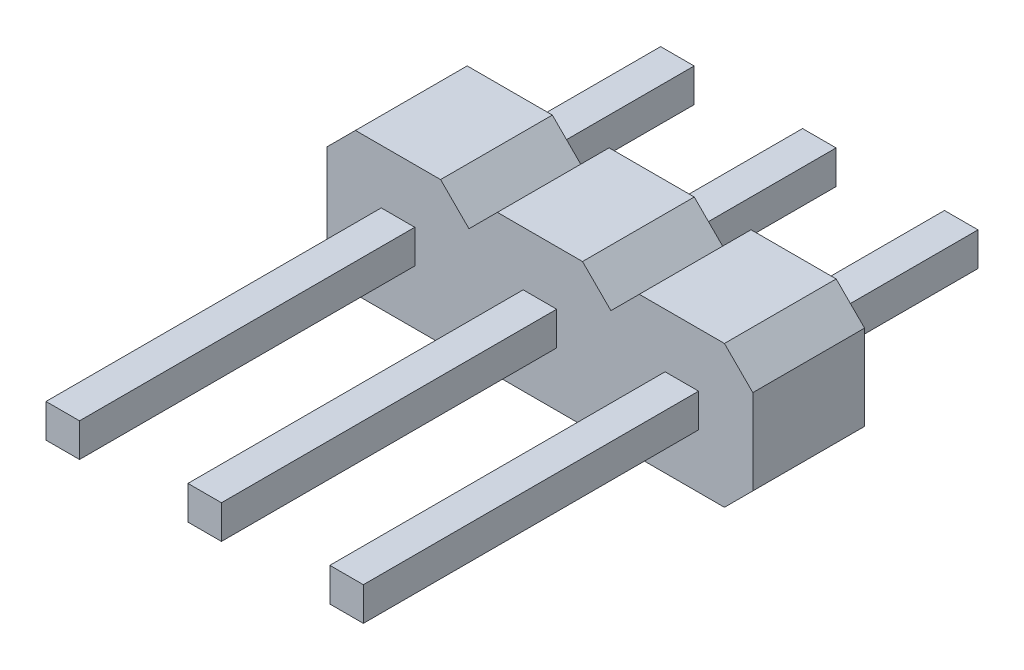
ISO-10303-21;
HEADER;
FILE_DESCRIPTION(('STEP AP214'),'2;1');
FILE_NAME('part.step','',(''),(''),'','','');
FILE_SCHEMA(('AUTOMOTIVE_DESIGN { 1 0 10303 214 1 1 1 1 }'));
ENDSEC;
DATA;
#1=APPLICATION_CONTEXT('core data for automotive mechanical design processes');
#2=APPLICATION_PROTOCOL_DEFINITION('international standard','automotive_design',2000,#1);
#3=PRODUCT_CONTEXT('',#1,'mechanical');
#4=PRODUCT('Part','Part','',(#3));
#5=PRODUCT_RELATED_PRODUCT_CATEGORY('part','',(#4));
#6=PRODUCT_DEFINITION_FORMATION('','',#4);
#7=PRODUCT_DEFINITION_CONTEXT('part definition',#1,'design');
#8=PRODUCT_DEFINITION('design','',#6,#7);
#9=PRODUCT_DEFINITION_SHAPE('','',#8);
#10=(LENGTH_UNIT() NAMED_UNIT(*) SI_UNIT(.MILLI.,.METRE.));
#11=(NAMED_UNIT(*) PLANE_ANGLE_UNIT() SI_UNIT($,.RADIAN.));
#12=(NAMED_UNIT(*) SI_UNIT($,.STERADIAN.) SOLID_ANGLE_UNIT());
#13=UNCERTAINTY_MEASURE_WITH_UNIT(LENGTH_MEASURE(1.E-05),#10,'distance_accuracy_value','');
#14=(GEOMETRIC_REPRESENTATION_CONTEXT(3) GLOBAL_UNCERTAINTY_ASSIGNED_CONTEXT((#13)) GLOBAL_UNIT_ASSIGNED_CONTEXT((#10,
#11,#12)) REPRESENTATION_CONTEXT('',''));
#15=CARTESIAN_POINT('',(0.,0.,0.));
#16=DIRECTION('',(0.,0.,1.));
#17=DIRECTION('',(1.,0.,0.));
#18=AXIS2_PLACEMENT_3D('',#15,#16,#17);
#19=CARTESIAN_POINT('',(0.,0.,2.));
#20=DIRECTION('',(0.,0.,1.));
#21=DIRECTION('',(1.,0.,0.));
#22=AXIS2_PLACEMENT_3D('',#19,#20,#21);
#23=PLANE('',#22);
#24=DIRECTION('',(0.,-1.,0.));
#25=VECTOR('',#24,1.);
#26=CARTESIAN_POINT('',(-1.27,0.762,2.));
#27=LINE('',#26,#25);
#28=CARTESIAN_POINT('',(-1.27,0.762,2.));
#29=VERTEX_POINT('',#28);
#30=CARTESIAN_POINT('',(-1.27,-0.762,2.));
#31=VERTEX_POINT('',#30);
#32=EDGE_CURVE('E11',#29,#31,#27,.T.);
#33=ORIENTED_EDGE('',*,*,#32,.T.);
#34=DIRECTION('',(0.707106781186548,-0.707106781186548,0.));
#35=VECTOR('',#34,1.);
#36=CARTESIAN_POINT('',(-1.27,-0.762,2.));
#37=LINE('',#36,#35);
#38=CARTESIAN_POINT('',(-0.762,-1.27,2.));
#39=VERTEX_POINT('',#38);
#40=EDGE_CURVE('E25',#31,#39,#37,.T.);
#41=ORIENTED_EDGE('',*,*,#40,.T.);
#42=DIRECTION('',(1.,0.,0.));
#43=VECTOR('',#42,1.);
#44=CARTESIAN_POINT('',(-0.762,-1.27,2.));
#45=LINE('',#44,#43);
#46=CARTESIAN_POINT('',(0.762,-1.27,2.));
#47=VERTEX_POINT('',#46);
#48=EDGE_CURVE('E882',#39,#47,#45,.T.);
#49=ORIENTED_EDGE('',*,*,#48,.T.);
#50=DIRECTION('',(0.707106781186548,0.707106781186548,0.));
#51=VECTOR('',#50,1.);
#52=CARTESIAN_POINT('',(1.27,-0.762,2.));
#53=LINE('',#52,#51);
#54=CARTESIAN_POINT('',(1.27,-0.762,2.));
#55=VERTEX_POINT('',#54);
#56=EDGE_CURVE('E878',#47,#55,#53,.T.);
#57=ORIENTED_EDGE('',*,*,#56,.T.);
#58=DIRECTION('',(0.707106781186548,-0.707106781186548,0.));
#59=VECTOR('',#58,1.);
#60=CARTESIAN_POINT('',(1.27,-0.762,2.));
#61=LINE('',#60,#59);
#62=CARTESIAN_POINT('',(1.778,-1.27,2.));
#63=VERTEX_POINT('',#62);
#64=EDGE_CURVE('E874',#55,#63,#61,.T.);
#65=ORIENTED_EDGE('',*,*,#64,.T.);
#66=DIRECTION('',(1.,0.,0.));
#67=VECTOR('',#66,1.);
#68=CARTESIAN_POINT('',(1.778,-1.27,2.));
#69=LINE('',#68,#67);
#70=CARTESIAN_POINT('',(3.302,-1.27,2.));
#71=VERTEX_POINT('',#70);
#72=EDGE_CURVE('E870',#63,#71,#69,.T.);
#73=ORIENTED_EDGE('',*,*,#72,.T.);
#74=DIRECTION('',(0.707106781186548,0.707106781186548,0.));
#75=VECTOR('',#74,1.);
#76=CARTESIAN_POINT('',(3.81,-0.762,2.));
#77=LINE('',#76,#75);
#78=CARTESIAN_POINT('',(3.81,-0.762,2.));
#79=VERTEX_POINT('',#78);
#80=EDGE_CURVE('E866',#71,#79,#77,.T.);
#81=ORIENTED_EDGE('',*,*,#80,.T.);
#82=DIRECTION('',(0.707106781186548,-0.707106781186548,0.));
#83=VECTOR('',#82,1.);
#84=CARTESIAN_POINT('',(3.81,-0.762,2.));
#85=LINE('',#84,#83);
#86=CARTESIAN_POINT('',(4.318,-1.27,2.));
#87=VERTEX_POINT('',#86);
#88=EDGE_CURVE('E862',#79,#87,#85,.T.);
#89=ORIENTED_EDGE('',*,*,#88,.T.);
#90=DIRECTION('',(1.,0.,0.));
#91=VECTOR('',#90,1.);
#92=CARTESIAN_POINT('',(4.318,-1.27,2.));
#93=LINE('',#92,#91);
#94=CARTESIAN_POINT('',(5.842,-1.27,2.));
#95=VERTEX_POINT('',#94);
#96=EDGE_CURVE('E858',#87,#95,#93,.T.);
#97=ORIENTED_EDGE('',*,*,#96,.T.);
#98=DIRECTION('',(0.707106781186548,0.707106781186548,0.));
#99=VECTOR('',#98,1.);
#100=CARTESIAN_POINT('',(6.35,-0.762,2.));
#101=LINE('',#100,#99);
#102=CARTESIAN_POINT('',(6.35,-0.762,2.));
#103=VERTEX_POINT('',#102);
#104=EDGE_CURVE('E854',#95,#103,#101,.T.);
#105=ORIENTED_EDGE('',*,*,#104,.T.);
#106=DIRECTION('',(0.,1.,0.));
#107=VECTOR('',#106,1.);
#108=CARTESIAN_POINT('',(6.35,0.762,2.));
#109=LINE('',#108,#107);
#110=CARTESIAN_POINT('',(6.35,0.762,2.));
#111=VERTEX_POINT('',#110);
#112=EDGE_CURVE('E850',#103,#111,#109,.T.);
#113=ORIENTED_EDGE('',*,*,#112,.T.);
#114=DIRECTION('',(-0.707106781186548,0.707106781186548,0.));
#115=VECTOR('',#114,1.);
#116=CARTESIAN_POINT('',(5.842,1.27,2.));
#117=LINE('',#116,#115);
#118=CARTESIAN_POINT('',(5.842,1.27,2.));
#119=VERTEX_POINT('',#118);
#120=EDGE_CURVE('E846',#111,#119,#117,.T.);
#121=ORIENTED_EDGE('',*,*,#120,.T.);
#122=DIRECTION('',(-1.,0.,0.));
#123=VECTOR('',#122,1.);
#124=CARTESIAN_POINT('',(4.318,1.27,2.));
#125=LINE('',#124,#123);
#126=CARTESIAN_POINT('',(4.318,1.27,2.));
#127=VERTEX_POINT('',#126);
#128=EDGE_CURVE('E842',#119,#127,#125,.T.);
#129=ORIENTED_EDGE('',*,*,#128,.T.);
#130=DIRECTION('',(-0.707106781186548,-0.707106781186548,0.));
#131=VECTOR('',#130,1.);
#132=CARTESIAN_POINT('',(4.318,1.27,2.));
#133=LINE('',#132,#131);
#134=CARTESIAN_POINT('',(3.81,0.762,2.));
#135=VERTEX_POINT('',#134);
#136=EDGE_CURVE('E838',#127,#135,#133,.T.);
#137=ORIENTED_EDGE('',*,*,#136,.T.);
#138=DIRECTION('',(-0.707106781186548,0.707106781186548,0.));
#139=VECTOR('',#138,1.);
#140=CARTESIAN_POINT('',(3.302,1.27,2.));
#141=LINE('',#140,#139);
#142=CARTESIAN_POINT('',(3.302,1.27,2.));
#143=VERTEX_POINT('',#142);
#144=EDGE_CURVE('E834',#135,#143,#141,.T.);
#145=ORIENTED_EDGE('',*,*,#144,.T.);
#146=DIRECTION('',(-1.,0.,0.));
#147=VECTOR('',#146,1.);
#148=CARTESIAN_POINT('',(1.778,1.27,2.));
#149=LINE('',#148,#147);
#150=CARTESIAN_POINT('',(1.778,1.27,2.));
#151=VERTEX_POINT('',#150);
#152=EDGE_CURVE('E830',#143,#151,#149,.T.);
#153=ORIENTED_EDGE('',*,*,#152,.T.);
#154=DIRECTION('',(-0.707106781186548,-0.707106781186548,0.));
#155=VECTOR('',#154,1.);
#156=CARTESIAN_POINT('',(1.778,1.27,2.));
#157=LINE('',#156,#155);
#158=CARTESIAN_POINT('',(1.27,0.762,2.));
#159=VERTEX_POINT('',#158);
#160=EDGE_CURVE('E826',#151,#159,#157,.T.);
#161=ORIENTED_EDGE('',*,*,#160,.T.);
#162=DIRECTION('',(-0.707106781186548,0.707106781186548,0.));
#163=VECTOR('',#162,1.);
#164=CARTESIAN_POINT('',(0.762,1.27,2.));
#165=LINE('',#164,#163);
#166=CARTESIAN_POINT('',(0.762,1.27,2.));
#167=VERTEX_POINT('',#166);
#168=EDGE_CURVE('E822',#159,#167,#165,.T.);
#169=ORIENTED_EDGE('',*,*,#168,.T.);
#170=DIRECTION('',(-1.,0.,0.));
#171=VECTOR('',#170,1.);
#172=CARTESIAN_POINT('',(-0.762,1.27,2.));
#173=LINE('',#172,#171);
#174=CARTESIAN_POINT('',(-0.762,1.27,2.));
#175=VERTEX_POINT('',#174);
#176=EDGE_CURVE('E818',#167,#175,#173,.T.);
#177=ORIENTED_EDGE('',*,*,#176,.T.);
#178=DIRECTION('',(-0.707106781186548,-0.707106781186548,0.));
#179=VECTOR('',#178,1.);
#180=CARTESIAN_POINT('',(-0.762,1.27,2.));
#181=LINE('',#180,#179);
#182=EDGE_CURVE('E814',#175,#29,#181,.T.);
#183=ORIENTED_EDGE('',*,*,#182,.T.);
#184=EDGE_LOOP('',(#33,#41,#49,#57,#65,#73,#81,#89,#97,#105,#113,#121,#129,#137,#145,#153,#161,
#169,#177,#183));
#185=FACE_BOUND('',#184,.T.);
#186=DIRECTION('',(-1.,0.,0.));
#187=VECTOR('',#186,1.);
#188=CARTESIAN_POINT('',(-0.3,0.3,2.));
#189=LINE('',#188,#187);
#190=CARTESIAN_POINT('',(0.3,0.3,2.));
#191=VERTEX_POINT('',#190);
#192=CARTESIAN_POINT('',(-0.3,0.3,2.));
#193=VERTEX_POINT('',#192);
#194=EDGE_CURVE('E809',#191,#193,#189,.T.);
#195=ORIENTED_EDGE('',*,*,#194,.F.);
#196=DIRECTION('',(0.,1.,0.));
#197=VECTOR('',#196,1.);
#198=CARTESIAN_POINT('',(0.3,0.3,2.));
#199=LINE('',#198,#197);
#200=CARTESIAN_POINT('',(0.3,-0.3,2.));
#201=VERTEX_POINT('',#200);
#202=EDGE_CURVE('E804',#201,#191,#199,.T.);
#203=ORIENTED_EDGE('',*,*,#202,.F.);
#204=DIRECTION('',(1.,0.,0.));
#205=VECTOR('',#204,1.);
#206=CARTESIAN_POINT('',(-0.3,-0.3,2.));
#207=LINE('',#206,#205);
#208=CARTESIAN_POINT('',(-0.3,-0.3,2.));
#209=VERTEX_POINT('',#208);
#210=EDGE_CURVE('E799',#209,#201,#207,.T.);
#211=ORIENTED_EDGE('',*,*,#210,.F.);
#212=DIRECTION('',(0.,-1.,0.));
#213=VECTOR('',#212,1.);
#214=CARTESIAN_POINT('',(-0.3,0.3,2.));
#215=LINE('',#214,#213);
#216=EDGE_CURVE('E794',#193,#209,#215,.T.);
#217=ORIENTED_EDGE('',*,*,#216,.F.);
#218=EDGE_LOOP('',(#195,#203,#211,#217));
#219=FACE_BOUND('',#218,.T.);
#220=DIRECTION('',(0.,1.,0.));
#221=VECTOR('',#220,1.);
#222=CARTESIAN_POINT('',(2.84,0.3,2.));
#223=LINE('',#222,#221);
#224=CARTESIAN_POINT('',(2.84,-0.3,2.));
#225=VERTEX_POINT('',#224);
#226=CARTESIAN_POINT('',(2.84,0.3,2.));
#227=VERTEX_POINT('',#226);
#228=EDGE_CURVE('E789',#225,#227,#223,.T.);
#229=ORIENTED_EDGE('',*,*,#228,.F.);
#230=DIRECTION('',(1.,0.,0.));
#231=VECTOR('',#230,1.);
#232=CARTESIAN_POINT('',(2.24,-0.3,2.));
#233=LINE('',#232,#231);
#234=CARTESIAN_POINT('',(2.24,-0.3,2.));
#235=VERTEX_POINT('',#234);
#236=EDGE_CURVE('E784',#235,#225,#233,.T.);
#237=ORIENTED_EDGE('',*,*,#236,.F.);
#238=DIRECTION('',(0.,-1.,0.));
#239=VECTOR('',#238,1.);
#240=CARTESIAN_POINT('',(2.24,0.3,2.));
#241=LINE('',#240,#239);
#242=CARTESIAN_POINT('',(2.24,0.3,2.));
#243=VERTEX_POINT('',#242);
#244=EDGE_CURVE('E779',#243,#235,#241,.T.);
#245=ORIENTED_EDGE('',*,*,#244,.F.);
#246=DIRECTION('',(-1.,0.,0.));
#247=VECTOR('',#246,1.);
#248=CARTESIAN_POINT('',(2.24,0.3,2.));
#249=LINE('',#248,#247);
#250=EDGE_CURVE('E774',#227,#243,#249,.T.);
#251=ORIENTED_EDGE('',*,*,#250,.F.);
#252=EDGE_LOOP('',(#229,#237,#245,#251));
#253=FACE_BOUND('',#252,.T.);
#254=DIRECTION('',(0.,1.,0.));
#255=VECTOR('',#254,1.);
#256=CARTESIAN_POINT('',(5.38,0.3,2.));
#257=LINE('',#256,#255);
#258=CARTESIAN_POINT('',(5.38,-0.3,2.));
#259=VERTEX_POINT('',#258);
#260=CARTESIAN_POINT('',(5.38,0.3,2.));
#261=VERTEX_POINT('',#260);
#262=EDGE_CURVE('E769',#259,#261,#257,.T.);
#263=ORIENTED_EDGE('',*,*,#262,.F.);
#264=DIRECTION('',(1.,0.,0.));
#265=VECTOR('',#264,1.);
#266=CARTESIAN_POINT('',(4.78,-0.3,2.));
#267=LINE('',#266,#265);
#268=CARTESIAN_POINT('',(4.78,-0.3,2.));
#269=VERTEX_POINT('',#268);
#270=EDGE_CURVE('E764',#269,#259,#267,.T.);
#271=ORIENTED_EDGE('',*,*,#270,.F.);
#272=DIRECTION('',(0.,-1.,0.));
#273=VECTOR('',#272,1.);
#274=CARTESIAN_POINT('',(4.78,0.3,2.));
#275=LINE('',#274,#273);
#276=CARTESIAN_POINT('',(4.78,0.3,2.));
#277=VERTEX_POINT('',#276);
#278=EDGE_CURVE('E759',#277,#269,#275,.T.);
#279=ORIENTED_EDGE('',*,*,#278,.F.);
#280=DIRECTION('',(-1.,0.,0.));
#281=VECTOR('',#280,1.);
#282=CARTESIAN_POINT('',(4.78,0.3,2.));
#283=LINE('',#282,#281);
#284=EDGE_CURVE('E754',#261,#277,#283,.T.);
#285=ORIENTED_EDGE('',*,*,#284,.F.);
#286=EDGE_LOOP('',(#263,#271,#279,#285));
#287=FACE_BOUND('',#286,.T.);
#288=ADVANCED_FACE('F17',(#185,#219,#253,#287),#23,.T.);
#289=CARTESIAN_POINT('',(4.78,0.3,-3.));
#290=DIRECTION('',(0.,1.,0.));
#291=DIRECTION('',(0.,0.,1.));
#292=AXIS2_PLACEMENT_3D('',#289,#290,#291);
#293=PLANE('',#292);
#294=DIRECTION('',(0.,0.,1.));
#295=VECTOR('',#294,1.);
#296=CARTESIAN_POINT('',(5.38,0.3,-3.));
#297=LINE('',#296,#295);
#298=CARTESIAN_POINT('',(5.38,0.3,8.));
#299=VERTEX_POINT('',#298);
#300=EDGE_CURVE('E749',#261,#299,#297,.T.);
#301=ORIENTED_EDGE('',*,*,#300,.F.);
#302=ORIENTED_EDGE('',*,*,#284,.T.);
#303=DIRECTION('',(0.,0.,1.));
#304=VECTOR('',#303,1.);
#305=CARTESIAN_POINT('',(4.78,0.3,-3.));
#306=LINE('',#305,#304);
#307=CARTESIAN_POINT('',(4.78,0.3,8.));
#308=VERTEX_POINT('',#307);
#309=EDGE_CURVE('E745',#277,#308,#306,.T.);
#310=ORIENTED_EDGE('',*,*,#309,.T.);
#311=DIRECTION('',(-1.,0.,0.));
#312=VECTOR('',#311,1.);
#313=CARTESIAN_POINT('',(4.78,0.3,8.));
#314=LINE('',#313,#312);
#315=EDGE_CURVE('E740',#299,#308,#314,.T.);
#316=ORIENTED_EDGE('',*,*,#315,.F.);
#317=EDGE_LOOP('',(#301,#302,#310,#316));
#318=FACE_BOUND('',#317,.T.);
#319=ADVANCED_FACE('F1000',(#318),#293,.T.);
#320=CARTESIAN_POINT('',(0.,0.,8.));
#321=DIRECTION('',(0.,0.,1.));
#322=DIRECTION('',(1.,0.,0.));
#323=AXIS2_PLACEMENT_3D('',#320,#321,#322);
#324=PLANE('',#323);
#325=DIRECTION('',(0.,-1.,0.));
#326=VECTOR('',#325,1.);
#327=CARTESIAN_POINT('',(4.78,0.3,8.));
#328=LINE('',#327,#326);
#329=CARTESIAN_POINT('',(4.78,-0.3,8.));
#330=VERTEX_POINT('',#329);
#331=EDGE_CURVE('E736',#308,#330,#328,.T.);
#332=ORIENTED_EDGE('',*,*,#331,.T.);
#333=DIRECTION('',(1.,0.,0.));
#334=VECTOR('',#333,1.);
#335=CARTESIAN_POINT('',(4.78,-0.3,8.));
#336=LINE('',#335,#334);
#337=CARTESIAN_POINT('',(5.38,-0.3,8.));
#338=VERTEX_POINT('',#337);
#339=EDGE_CURVE('E732',#330,#338,#336,.T.);
#340=ORIENTED_EDGE('',*,*,#339,.T.);
#341=DIRECTION('',(0.,1.,0.));
#342=VECTOR('',#341,1.);
#343=CARTESIAN_POINT('',(5.38,0.3,8.));
#344=LINE('',#343,#342);
#345=EDGE_CURVE('E727',#338,#299,#344,.T.);
#346=ORIENTED_EDGE('',*,*,#345,.T.);
#347=ORIENTED_EDGE('',*,*,#315,.T.);
#348=EDGE_LOOP('',(#332,#340,#346,#347));
#349=FACE_BOUND('',#348,.T.);
#350=ADVANCED_FACE('F1004',(#349),#324,.T.);
#351=CARTESIAN_POINT('',(5.38,0.3,-3.));
#352=DIRECTION('',(1.,0.,0.));
#353=DIRECTION('',(0.,0.,-1.));
#354=AXIS2_PLACEMENT_3D('',#351,#352,#353);
#355=PLANE('',#354);
#356=DIRECTION('',(0.,0.,1.));
#357=VECTOR('',#356,1.);
#358=CARTESIAN_POINT('',(5.38,-0.3,-3.));
#359=LINE('',#358,#357);
#360=EDGE_CURVE('E722',#259,#338,#359,.T.);
#361=ORIENTED_EDGE('',*,*,#360,.F.);
#362=ORIENTED_EDGE('',*,*,#262,.T.);
#363=ORIENTED_EDGE('',*,*,#300,.T.);
#364=ORIENTED_EDGE('',*,*,#345,.F.);
#365=EDGE_LOOP('',(#361,#362,#363,#364));
#366=FACE_BOUND('',#365,.T.);
#367=ADVANCED_FACE('F1009',(#366),#355,.T.);
#368=CARTESIAN_POINT('',(4.78,-0.3,-3.));
#369=DIRECTION('',(0.,-1.,0.));
#370=DIRECTION('',(0.,0.,-1.));
#371=AXIS2_PLACEMENT_3D('',#368,#369,#370);
#372=PLANE('',#371);
#373=DIRECTION('',(0.,0.,1.));
#374=VECTOR('',#373,1.);
#375=CARTESIAN_POINT('',(4.78,-0.3,-3.));
#376=LINE('',#375,#374);
#377=EDGE_CURVE('E717',#269,#330,#376,.T.);
#378=ORIENTED_EDGE('',*,*,#377,.F.);
#379=ORIENTED_EDGE('',*,*,#270,.T.);
#380=ORIENTED_EDGE('',*,*,#360,.T.);
#381=ORIENTED_EDGE('',*,*,#339,.F.);
#382=EDGE_LOOP('',(#378,#379,#380,#381));
#383=FACE_BOUND('',#382,.T.);
#384=ADVANCED_FACE('F1016',(#383),#372,.T.);
#385=CARTESIAN_POINT('',(4.78,0.3,-3.));
#386=DIRECTION('',(-1.,0.,0.));
#387=DIRECTION('',(0.,0.,1.));
#388=AXIS2_PLACEMENT_3D('',#385,#386,#387);
#389=PLANE('',#388);
#390=ORIENTED_EDGE('',*,*,#309,.F.);
#391=ORIENTED_EDGE('',*,*,#278,.T.);
#392=ORIENTED_EDGE('',*,*,#377,.T.);
#393=ORIENTED_EDGE('',*,*,#331,.F.);
#394=EDGE_LOOP('',(#390,#391,#392,#393));
#395=FACE_BOUND('',#394,.T.);
#396=ADVANCED_FACE('F1020',(#395),#389,.T.);
#397=CARTESIAN_POINT('',(2.24,0.3,-3.));
#398=DIRECTION('',(0.,1.,0.));
#399=DIRECTION('',(0.,0.,1.));
#400=AXIS2_PLACEMENT_3D('',#397,#398,#399);
#401=PLANE('',#400);
#402=DIRECTION('',(0.,0.,1.));
#403=VECTOR('',#402,1.);
#404=CARTESIAN_POINT('',(2.84,0.3,-3.));
#405=LINE('',#404,#403);
#406=CARTESIAN_POINT('',(2.84,0.3,8.));
#407=VERTEX_POINT('',#406);
#408=EDGE_CURVE('E712',#227,#407,#405,.T.);
#409=ORIENTED_EDGE('',*,*,#408,.F.);
#410=ORIENTED_EDGE('',*,*,#250,.T.);
#411=DIRECTION('',(0.,0.,1.));
#412=VECTOR('',#411,1.);
#413=CARTESIAN_POINT('',(2.24,0.3,-3.));
#414=LINE('',#413,#412);
#415=CARTESIAN_POINT('',(2.24,0.3,8.));
#416=VERTEX_POINT('',#415);
#417=EDGE_CURVE('E708',#243,#416,#414,.T.);
#418=ORIENTED_EDGE('',*,*,#417,.T.);
#419=DIRECTION('',(-1.,0.,0.));
#420=VECTOR('',#419,1.);
#421=CARTESIAN_POINT('',(2.24,0.3,8.));
#422=LINE('',#421,#420);
#423=EDGE_CURVE('E703',#407,#416,#422,.T.);
#424=ORIENTED_EDGE('',*,*,#423,.F.);
#425=EDGE_LOOP('',(#409,#410,#418,#424));
#426=FACE_BOUND('',#425,.T.);
#427=ADVANCED_FACE('F1024',(#426),#401,.T.);
#428=CARTESIAN_POINT('',(0.,0.,8.));
#429=DIRECTION('',(0.,0.,1.));
#430=DIRECTION('',(1.,0.,0.));
#431=AXIS2_PLACEMENT_3D('',#428,#429,#430);
#432=PLANE('',#431);
#433=DIRECTION('',(0.,-1.,0.));
#434=VECTOR('',#433,1.);
#435=CARTESIAN_POINT('',(2.24,0.3,8.));
#436=LINE('',#435,#434);
#437=CARTESIAN_POINT('',(2.24,-0.3,8.));
#438=VERTEX_POINT('',#437);
#439=EDGE_CURVE('E699',#416,#438,#436,.T.);
#440=ORIENTED_EDGE('',*,*,#439,.T.);
#441=DIRECTION('',(1.,0.,0.));
#442=VECTOR('',#441,1.);
#443=CARTESIAN_POINT('',(2.24,-0.3,8.));
#444=LINE('',#443,#442);
#445=CARTESIAN_POINT('',(2.84,-0.3,8.));
#446=VERTEX_POINT('',#445);
#447=EDGE_CURVE('E695',#438,#446,#444,.T.);
#448=ORIENTED_EDGE('',*,*,#447,.T.);
#449=DIRECTION('',(0.,1.,0.));
#450=VECTOR('',#449,1.);
#451=CARTESIAN_POINT('',(2.84,0.3,8.));
#452=LINE('',#451,#450);
#453=EDGE_CURVE('E690',#446,#407,#452,.T.);
#454=ORIENTED_EDGE('',*,*,#453,.T.);
#455=ORIENTED_EDGE('',*,*,#423,.T.);
#456=EDGE_LOOP('',(#440,#448,#454,#455));
#457=FACE_BOUND('',#456,.T.);
#458=ADVANCED_FACE('F1028',(#457),#432,.T.);
#459=CARTESIAN_POINT('',(2.84,0.3,-3.));
#460=DIRECTION('',(1.,0.,0.));
#461=DIRECTION('',(0.,0.,-1.));
#462=AXIS2_PLACEMENT_3D('',#459,#460,#461);
#463=PLANE('',#462);
#464=DIRECTION('',(0.,0.,1.));
#465=VECTOR('',#464,1.);
#466=CARTESIAN_POINT('',(2.84,-0.3,-3.));
#467=LINE('',#466,#465);
#468=EDGE_CURVE('E685',#225,#446,#467,.T.);
#469=ORIENTED_EDGE('',*,*,#468,.F.);
#470=ORIENTED_EDGE('',*,*,#228,.T.);
#471=ORIENTED_EDGE('',*,*,#408,.T.);
#472=ORIENTED_EDGE('',*,*,#453,.F.);
#473=EDGE_LOOP('',(#469,#470,#471,#472));
#474=FACE_BOUND('',#473,.T.);
#475=ADVANCED_FACE('F1032',(#474),#463,.T.);
#476=CARTESIAN_POINT('',(2.24,-0.3,-3.));
#477=DIRECTION('',(0.,-1.,0.));
#478=DIRECTION('',(0.,0.,-1.));
#479=AXIS2_PLACEMENT_3D('',#476,#477,#478);
#480=PLANE('',#479);
#481=DIRECTION('',(0.,0.,1.));
#482=VECTOR('',#481,1.);
#483=CARTESIAN_POINT('',(2.24,-0.3,-3.));
#484=LINE('',#483,#482);
#485=EDGE_CURVE('E680',#235,#438,#484,.T.);
#486=ORIENTED_EDGE('',*,*,#485,.F.);
#487=ORIENTED_EDGE('',*,*,#236,.T.);
#488=ORIENTED_EDGE('',*,*,#468,.T.);
#489=ORIENTED_EDGE('',*,*,#447,.F.);
#490=EDGE_LOOP('',(#486,#487,#488,#489));
#491=FACE_BOUND('',#490,.T.);
#492=ADVANCED_FACE('F1036',(#491),#480,.T.);
#493=CARTESIAN_POINT('',(2.24,0.3,-3.));
#494=DIRECTION('',(-1.,0.,0.));
#495=DIRECTION('',(0.,0.,1.));
#496=AXIS2_PLACEMENT_3D('',#493,#494,#495);
#497=PLANE('',#496);
#498=ORIENTED_EDGE('',*,*,#417,.F.);
#499=ORIENTED_EDGE('',*,*,#244,.T.);
#500=ORIENTED_EDGE('',*,*,#485,.T.);
#501=ORIENTED_EDGE('',*,*,#439,.F.);
#502=EDGE_LOOP('',(#498,#499,#500,#501));
#503=FACE_BOUND('',#502,.T.);
#504=ADVANCED_FACE('F1040',(#503),#497,.T.);
#505=CARTESIAN_POINT('',(-0.3,0.3,-3.));
#506=DIRECTION('',(-1.,0.,0.));
#507=DIRECTION('',(0.,0.,1.));
#508=AXIS2_PLACEMENT_3D('',#505,#506,#507);
#509=PLANE('',#508);
#510=DIRECTION('',(0.,0.,1.));
#511=VECTOR('',#510,1.);
#512=CARTESIAN_POINT('',(-0.3,0.3,-3.));
#513=LINE('',#512,#511);
#514=CARTESIAN_POINT('',(-0.3,0.3,8.));
#515=VERTEX_POINT('',#514);
#516=EDGE_CURVE('E675',#193,#515,#513,.T.);
#517=ORIENTED_EDGE('',*,*,#516,.F.);
#518=ORIENTED_EDGE('',*,*,#216,.T.);
#519=DIRECTION('',(0.,0.,1.));
#520=VECTOR('',#519,1.);
#521=CARTESIAN_POINT('',(-0.3,-0.3,-3.));
#522=LINE('',#521,#520);
#523=CARTESIAN_POINT('',(-0.3,-0.3,8.));
#524=VERTEX_POINT('',#523);
#525=EDGE_CURVE('E671',#209,#524,#522,.T.);
#526=ORIENTED_EDGE('',*,*,#525,.T.);
#527=DIRECTION('',(0.,-1.,0.));
#528=VECTOR('',#527,1.);
#529=CARTESIAN_POINT('',(-0.3,0.3,8.));
#530=LINE('',#529,#528);
#531=EDGE_CURVE('E666',#515,#524,#530,.T.);
#532=ORIENTED_EDGE('',*,*,#531,.F.);
#533=EDGE_LOOP('',(#517,#518,#526,#532));
#534=FACE_BOUND('',#533,.T.);
#535=ADVANCED_FACE('F1044',(#534),#509,.T.);
#536=CARTESIAN_POINT('',(0.,0.,8.));
#537=DIRECTION('',(0.,0.,1.));
#538=DIRECTION('',(1.,0.,0.));
#539=AXIS2_PLACEMENT_3D('',#536,#537,#538);
#540=PLANE('',#539);
#541=ORIENTED_EDGE('',*,*,#531,.T.);
#542=DIRECTION('',(1.,0.,0.));
#543=VECTOR('',#542,1.);
#544=CARTESIAN_POINT('',(-0.3,-0.3,8.));
#545=LINE('',#544,#543);
#546=CARTESIAN_POINT('',(0.3,-0.3,8.));
#547=VERTEX_POINT('',#546);
#548=EDGE_CURVE('E662',#524,#547,#545,.T.);
#549=ORIENTED_EDGE('',*,*,#548,.T.);
#550=DIRECTION('',(0.,1.,0.));
#551=VECTOR('',#550,1.);
#552=CARTESIAN_POINT('',(0.3,0.3,8.));
#553=LINE('',#552,#551);
#554=CARTESIAN_POINT('',(0.3,0.3,8.));
#555=VERTEX_POINT('',#554);
#556=EDGE_CURVE('E658',#547,#555,#553,.T.);
#557=ORIENTED_EDGE('',*,*,#556,.T.);
#558=DIRECTION('',(-1.,0.,0.));
#559=VECTOR('',#558,1.);
#560=CARTESIAN_POINT('',(-0.3,0.3,8.));
#561=LINE('',#560,#559);
#562=EDGE_CURVE('E653',#555,#515,#561,.T.);
#563=ORIENTED_EDGE('',*,*,#562,.T.);
#564=EDGE_LOOP('',(#541,#549,#557,#563));
#565=FACE_BOUND('',#564,.T.);
#566=ADVANCED_FACE('F1048',(#565),#540,.T.);
#567=CARTESIAN_POINT('',(-0.3,0.3,-3.));
#568=DIRECTION('',(0.,1.,0.));
#569=DIRECTION('',(0.,0.,1.));
#570=AXIS2_PLACEMENT_3D('',#567,#568,#569);
#571=PLANE('',#570);
#572=DIRECTION('',(0.,0.,1.));
#573=VECTOR('',#572,1.);
#574=CARTESIAN_POINT('',(0.3,0.3,-3.));
#575=LINE('',#574,#573);
#576=EDGE_CURVE('E648',#191,#555,#575,.T.);
#577=ORIENTED_EDGE('',*,*,#576,.F.);
#578=ORIENTED_EDGE('',*,*,#194,.T.);
#579=ORIENTED_EDGE('',*,*,#516,.T.);
#580=ORIENTED_EDGE('',*,*,#562,.F.);
#581=EDGE_LOOP('',(#577,#578,#579,#580));
#582=FACE_BOUND('',#581,.T.);
#583=ADVANCED_FACE('F1052',(#582),#571,.T.);
#584=CARTESIAN_POINT('',(0.3,0.3,-3.));
#585=DIRECTION('',(1.,0.,0.));
#586=DIRECTION('',(0.,0.,-1.));
#587=AXIS2_PLACEMENT_3D('',#584,#585,#586);
#588=PLANE('',#587);
#589=DIRECTION('',(0.,0.,1.));
#590=VECTOR('',#589,1.);
#591=CARTESIAN_POINT('',(0.3,-0.3,-3.));
#592=LINE('',#591,#590);
#593=EDGE_CURVE('E643',#201,#547,#592,.T.);
#594=ORIENTED_EDGE('',*,*,#593,.F.);
#595=ORIENTED_EDGE('',*,*,#202,.T.);
#596=ORIENTED_EDGE('',*,*,#576,.T.);
#597=ORIENTED_EDGE('',*,*,#556,.F.);
#598=EDGE_LOOP('',(#594,#595,#596,#597));
#599=FACE_BOUND('',#598,.T.);
#600=ADVANCED_FACE('F1056',(#599),#588,.T.);
#601=CARTESIAN_POINT('',(-0.3,-0.3,-3.));
#602=DIRECTION('',(0.,-1.,0.));
#603=DIRECTION('',(0.,0.,-1.));
#604=AXIS2_PLACEMENT_3D('',#601,#602,#603);
#605=PLANE('',#604);
#606=ORIENTED_EDGE('',*,*,#525,.F.);
#607=ORIENTED_EDGE('',*,*,#210,.T.);
#608=ORIENTED_EDGE('',*,*,#593,.T.);
#609=ORIENTED_EDGE('',*,*,#548,.F.);
#610=EDGE_LOOP('',(#606,#607,#608,#609));
#611=FACE_BOUND('',#610,.T.);
#612=ADVANCED_FACE('F1060',(#611),#605,.T.);
#613=CARTESIAN_POINT('',(-0.762,1.27,2.));
#614=DIRECTION('',(0.707106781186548,-0.707106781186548,0.));
#615=DIRECTION('',(0.707106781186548,0.707106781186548,0.));
#616=AXIS2_PLACEMENT_3D('',#613,#614,#615);
#617=PLANE('',#616);
#618=DIRECTION('',(-0.707106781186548,-0.707106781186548,0.));
#619=VECTOR('',#618,1.);
#620=CARTESIAN_POINT('',(-0.762,1.27,0.));
#621=LINE('',#620,#619);
#622=CARTESIAN_POINT('',(-0.762,1.27,0.));
#623=VERTEX_POINT('',#622);
#624=CARTESIAN_POINT('',(-1.27,0.762,0.));
#625=VERTEX_POINT('',#624);
#626=EDGE_CURVE('E639',#623,#625,#621,.T.);
#627=ORIENTED_EDGE('',*,*,#626,.T.);
#628=DIRECTION('',(0.,0.,-1.));
#629=VECTOR('',#628,1.);
#630=CARTESIAN_POINT('',(-1.27,0.762,2.));
#631=LINE('',#630,#629);
#632=EDGE_CURVE('E634',#29,#625,#631,.T.);
#633=ORIENTED_EDGE('',*,*,#632,.F.);
#634=ORIENTED_EDGE('',*,*,#182,.F.);
#635=DIRECTION('',(0.,0.,-1.));
#636=VECTOR('',#635,1.);
#637=CARTESIAN_POINT('',(-0.762,1.27,2.));
#638=LINE('',#637,#636);
#639=EDGE_CURVE('E630',#175,#623,#638,.T.);
#640=ORIENTED_EDGE('',*,*,#639,.T.);
#641=EDGE_LOOP('',(#627,#633,#634,#640));
#642=FACE_BOUND('',#641,.T.);
#643=ADVANCED_FACE('F984',(#642),#617,.F.);
#644=CARTESIAN_POINT('',(-0.762,1.27,2.));
#645=DIRECTION('',(0.,-1.,0.));
#646=DIRECTION('',(0.,0.,-1.));
#647=AXIS2_PLACEMENT_3D('',#644,#645,#646);
#648=PLANE('',#647);
#649=DIRECTION('',(-1.,0.,0.));
#650=VECTOR('',#649,1.);
#651=CARTESIAN_POINT('',(-0.762,1.27,0.));
#652=LINE('',#651,#650);
#653=CARTESIAN_POINT('',(0.762,1.27,0.));
#654=VERTEX_POINT('',#653);
#655=EDGE_CURVE('E625',#654,#623,#652,.T.);
#656=ORIENTED_EDGE('',*,*,#655,.T.);
#657=ORIENTED_EDGE('',*,*,#639,.F.);
#658=ORIENTED_EDGE('',*,*,#176,.F.);
#659=DIRECTION('',(0.,0.,-1.));
#660=VECTOR('',#659,1.);
#661=CARTESIAN_POINT('',(0.762,1.27,2.));
#662=LINE('',#661,#660);
#663=EDGE_CURVE('E621',#167,#654,#662,.T.);
#664=ORIENTED_EDGE('',*,*,#663,.T.);
#665=EDGE_LOOP('',(#656,#657,#658,#664));
#666=FACE_BOUND('',#665,.T.);
#667=ADVANCED_FACE('F980',(#666),#648,.F.);
#668=CARTESIAN_POINT('',(0.762,1.27,2.));
#669=DIRECTION('',(-0.707106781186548,-0.707106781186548,0.));
#670=DIRECTION('',(0.707106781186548,-0.707106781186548,0.));
#671=AXIS2_PLACEMENT_3D('',#668,#669,#670);
#672=PLANE('',#671);
#673=DIRECTION('',(-0.707106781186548,0.707106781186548,0.));
#674=VECTOR('',#673,1.);
#675=CARTESIAN_POINT('',(0.762,1.27,0.));
#676=LINE('',#675,#674);
#677=CARTESIAN_POINT('',(1.27,0.762,0.));
#678=VERTEX_POINT('',#677);
#679=EDGE_CURVE('E616',#678,#654,#676,.T.);
#680=ORIENTED_EDGE('',*,*,#679,.T.);
#681=ORIENTED_EDGE('',*,*,#663,.F.);
#682=ORIENTED_EDGE('',*,*,#168,.F.);
#683=DIRECTION('',(0.,0.,-1.));
#684=VECTOR('',#683,1.);
#685=CARTESIAN_POINT('',(1.27,0.762,2.));
#686=LINE('',#685,#684);
#687=EDGE_CURVE('E612',#159,#678,#686,.T.);
#688=ORIENTED_EDGE('',*,*,#687,.T.);
#689=EDGE_LOOP('',(#680,#681,#682,#688));
#690=FACE_BOUND('',#689,.T.);
#691=ADVANCED_FACE('F967',(#690),#672,.F.);
#692=CARTESIAN_POINT('',(1.778,1.27,2.));
#693=DIRECTION('',(0.707106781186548,-0.707106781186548,0.));
#694=DIRECTION('',(0.707106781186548,0.707106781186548,0.));
#695=AXIS2_PLACEMENT_3D('',#692,#693,#694);
#696=PLANE('',#695);
#697=DIRECTION('',(-0.707106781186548,-0.707106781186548,0.));
#698=VECTOR('',#697,1.);
#699=CARTESIAN_POINT('',(1.778,1.27,0.));
#700=LINE('',#699,#698);
#701=CARTESIAN_POINT('',(1.778,1.27,0.));
#702=VERTEX_POINT('',#701);
#703=EDGE_CURVE('E607',#702,#678,#700,.T.);
#704=ORIENTED_EDGE('',*,*,#703,.T.);
#705=ORIENTED_EDGE('',*,*,#687,.F.);
#706=ORIENTED_EDGE('',*,*,#160,.F.);
#707=DIRECTION('',(0.,0.,-1.));
#708=VECTOR('',#707,1.);
#709=CARTESIAN_POINT('',(1.778,1.27,2.));
#710=LINE('',#709,#708);
#711=EDGE_CURVE('E603',#151,#702,#710,.T.);
#712=ORIENTED_EDGE('',*,*,#711,.T.);
#713=EDGE_LOOP('',(#704,#705,#706,#712));
#714=FACE_BOUND('',#713,.T.);
#715=ADVANCED_FACE('F969',(#714),#696,.F.);
#716=CARTESIAN_POINT('',(1.778,1.27,2.));
#717=DIRECTION('',(0.,-1.,0.));
#718=DIRECTION('',(0.,0.,-1.));
#719=AXIS2_PLACEMENT_3D('',#716,#717,#718);
#720=PLANE('',#719);
#721=DIRECTION('',(-1.,0.,0.));
#722=VECTOR('',#721,1.);
#723=CARTESIAN_POINT('',(1.778,1.27,0.));
#724=LINE('',#723,#722);
#725=CARTESIAN_POINT('',(3.302,1.27,0.));
#726=VERTEX_POINT('',#725);
#727=EDGE_CURVE('E598',#726,#702,#724,.T.);
#728=ORIENTED_EDGE('',*,*,#727,.T.);
#729=ORIENTED_EDGE('',*,*,#711,.F.);
#730=ORIENTED_EDGE('',*,*,#152,.F.);
#731=DIRECTION('',(0.,0.,-1.));
#732=VECTOR('',#731,1.);
#733=CARTESIAN_POINT('',(3.302,1.27,2.));
#734=LINE('',#733,#732);
#735=EDGE_CURVE('E594',#143,#726,#734,.T.);
#736=ORIENTED_EDGE('',*,*,#735,.T.);
#737=EDGE_LOOP('',(#728,#729,#730,#736));
#738=FACE_BOUND('',#737,.T.);
#739=ADVANCED_FACE('F960',(#738),#720,.F.);
#740=CARTESIAN_POINT('',(3.302,1.27,2.));
#741=DIRECTION('',(-0.707106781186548,-0.707106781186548,0.));
#742=DIRECTION('',(0.707106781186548,-0.707106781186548,0.));
#743=AXIS2_PLACEMENT_3D('',#740,#741,#742);
#744=PLANE('',#743);
#745=DIRECTION('',(-0.707106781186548,0.707106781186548,0.));
#746=VECTOR('',#745,1.);
#747=CARTESIAN_POINT('',(3.302,1.27,0.));
#748=LINE('',#747,#746);
#749=CARTESIAN_POINT('',(3.81,0.762,0.));
#750=VERTEX_POINT('',#749);
#751=EDGE_CURVE('E589',#750,#726,#748,.T.);
#752=ORIENTED_EDGE('',*,*,#751,.T.);
#753=ORIENTED_EDGE('',*,*,#735,.F.);
#754=ORIENTED_EDGE('',*,*,#144,.F.);
#755=DIRECTION('',(0.,0.,-1.));
#756=VECTOR('',#755,1.);
#757=CARTESIAN_POINT('',(3.81,0.762,2.));
#758=LINE('',#757,#756);
#759=EDGE_CURVE('E585',#135,#750,#758,.T.);
#760=ORIENTED_EDGE('',*,*,#759,.T.);
#761=EDGE_LOOP('',(#752,#753,#754,#760));
#762=FACE_BOUND('',#761,.T.);
#763=ADVANCED_FACE('F954',(#762),#744,.F.);
#764=CARTESIAN_POINT('',(4.318,1.27,2.));
#765=DIRECTION('',(0.707106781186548,-0.707106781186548,0.));
#766=DIRECTION('',(0.707106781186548,0.707106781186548,0.));
#767=AXIS2_PLACEMENT_3D('',#764,#765,#766);
#768=PLANE('',#767);
#769=DIRECTION('',(-0.707106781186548,-0.707106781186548,0.));
#770=VECTOR('',#769,1.);
#771=CARTESIAN_POINT('',(4.318,1.27,0.));
#772=LINE('',#771,#770);
#773=CARTESIAN_POINT('',(4.318,1.27,0.));
#774=VERTEX_POINT('',#773);
#775=EDGE_CURVE('E580',#774,#750,#772,.T.);
#776=ORIENTED_EDGE('',*,*,#775,.T.);
#777=ORIENTED_EDGE('',*,*,#759,.F.);
#778=ORIENTED_EDGE('',*,*,#136,.F.);
#779=DIRECTION('',(0.,0.,-1.));
#780=VECTOR('',#779,1.);
#781=CARTESIAN_POINT('',(4.318,1.27,2.));
#782=LINE('',#781,#780);
#783=EDGE_CURVE('E576',#127,#774,#782,.T.);
#784=ORIENTED_EDGE('',*,*,#783,.T.);
#785=EDGE_LOOP('',(#776,#777,#778,#784));
#786=FACE_BOUND('',#785,.T.);
#787=ADVANCED_FACE('F950',(#786),#768,.F.);
#788=CARTESIAN_POINT('',(4.318,1.27,2.));
#789=DIRECTION('',(0.,-1.,0.));
#790=DIRECTION('',(0.,0.,-1.));
#791=AXIS2_PLACEMENT_3D('',#788,#789,#790);
#792=PLANE('',#791);
#793=DIRECTION('',(-1.,0.,0.));
#794=VECTOR('',#793,1.);
#795=CARTESIAN_POINT('',(4.318,1.27,0.));
#796=LINE('',#795,#794);
#797=CARTESIAN_POINT('',(5.842,1.27,0.));
#798=VERTEX_POINT('',#797);
#799=EDGE_CURVE('E571',#798,#774,#796,.T.);
#800=ORIENTED_EDGE('',*,*,#799,.T.);
#801=ORIENTED_EDGE('',*,*,#783,.F.);
#802=ORIENTED_EDGE('',*,*,#128,.F.);
#803=DIRECTION('',(0.,0.,-1.));
#804=VECTOR('',#803,1.);
#805=CARTESIAN_POINT('',(5.842,1.27,2.));
#806=LINE('',#805,#804);
#807=EDGE_CURVE('E567',#119,#798,#806,.T.);
#808=ORIENTED_EDGE('',*,*,#807,.T.);
#809=EDGE_LOOP('',(#800,#801,#802,#808));
#810=FACE_BOUND('',#809,.T.);
#811=ADVANCED_FACE('F945',(#810),#792,.F.);
#812=CARTESIAN_POINT('',(5.842,1.27,2.));
#813=DIRECTION('',(-0.707106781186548,-0.707106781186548,0.));
#814=DIRECTION('',(0.707106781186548,-0.707106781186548,0.));
#815=AXIS2_PLACEMENT_3D('',#812,#813,#814);
#816=PLANE('',#815);
#817=DIRECTION('',(-0.707106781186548,0.707106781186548,0.));
#818=VECTOR('',#817,1.);
#819=CARTESIAN_POINT('',(5.842,1.27,0.));
#820=LINE('',#819,#818);
#821=CARTESIAN_POINT('',(6.35,0.762,0.));
#822=VERTEX_POINT('',#821);
#823=EDGE_CURVE('E562',#822,#798,#820,.T.);
#824=ORIENTED_EDGE('',*,*,#823,.T.);
#825=ORIENTED_EDGE('',*,*,#807,.F.);
#826=ORIENTED_EDGE('',*,*,#120,.F.);
#827=DIRECTION('',(0.,0.,-1.));
#828=VECTOR('',#827,1.);
#829=CARTESIAN_POINT('',(6.35,0.762,2.));
#830=LINE('',#829,#828);
#831=EDGE_CURVE('E558',#111,#822,#830,.T.);
#832=ORIENTED_EDGE('',*,*,#831,.T.);
#833=EDGE_LOOP('',(#824,#825,#826,#832));
#834=FACE_BOUND('',#833,.T.);
#835=ADVANCED_FACE('F941',(#834),#816,.F.);
#836=CARTESIAN_POINT('',(6.35,0.762,2.));
#837=DIRECTION('',(-1.,0.,0.));
#838=DIRECTION('',(0.,0.,1.));
#839=AXIS2_PLACEMENT_3D('',#836,#837,#838);
#840=PLANE('',#839);
#841=DIRECTION('',(0.,1.,0.));
#842=VECTOR('',#841,1.);
#843=CARTESIAN_POINT('',(6.35,0.762,0.));
#844=LINE('',#843,#842);
#845=CARTESIAN_POINT('',(6.35,-0.762,0.));
#846=VERTEX_POINT('',#845);
#847=EDGE_CURVE('E553',#846,#822,#844,.T.);
#848=ORIENTED_EDGE('',*,*,#847,.T.);
#849=ORIENTED_EDGE('',*,*,#831,.F.);
#850=ORIENTED_EDGE('',*,*,#112,.F.);
#851=DIRECTION('',(0.,0.,-1.));
#852=VECTOR('',#851,1.);
#853=CARTESIAN_POINT('',(6.35,-0.762,2.));
#854=LINE('',#853,#852);
#855=EDGE_CURVE('E549',#103,#846,#854,.T.);
#856=ORIENTED_EDGE('',*,*,#855,.T.);
#857=EDGE_LOOP('',(#848,#849,#850,#856));
#858=FACE_BOUND('',#857,.T.);
#859=ADVANCED_FACE('F935',(#858),#840,.F.);
#860=CARTESIAN_POINT('',(6.35,-0.762,2.));
#861=DIRECTION('',(-0.707106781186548,0.707106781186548,0.));
#862=DIRECTION('',(-0.707106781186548,-0.707106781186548,0.));
#863=AXIS2_PLACEMENT_3D('',#860,#861,#862);
#864=PLANE('',#863);
#865=DIRECTION('',(0.707106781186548,0.707106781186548,0.));
#866=VECTOR('',#865,1.);
#867=CARTESIAN_POINT('',(6.35,-0.762,0.));
#868=LINE('',#867,#866);
#869=CARTESIAN_POINT('',(5.842,-1.27,0.));
#870=VERTEX_POINT('',#869);
#871=EDGE_CURVE('E544',#870,#846,#868,.T.);
#872=ORIENTED_EDGE('',*,*,#871,.T.);
#873=ORIENTED_EDGE('',*,*,#855,.F.);
#874=ORIENTED_EDGE('',*,*,#104,.F.);
#875=DIRECTION('',(0.,0.,-1.));
#876=VECTOR('',#875,1.);
#877=CARTESIAN_POINT('',(5.842,-1.27,2.));
#878=LINE('',#877,#876);
#879=EDGE_CURVE('E540',#95,#870,#878,.T.);
#880=ORIENTED_EDGE('',*,*,#879,.T.);
#881=EDGE_LOOP('',(#872,#873,#874,#880));
#882=FACE_BOUND('',#881,.T.);
#883=ADVANCED_FACE('F930',(#882),#864,.F.);
#884=CARTESIAN_POINT('',(4.318,-1.27,2.));
#885=DIRECTION('',(0.,1.,0.));
#886=DIRECTION('',(-1.,0.,0.));
#887=AXIS2_PLACEMENT_3D('',#884,#885,#886);
#888=PLANE('',#887);
#889=DIRECTION('',(1.,0.,0.));
#890=VECTOR('',#889,1.);
#891=CARTESIAN_POINT('',(4.318,-1.27,0.));
#892=LINE('',#891,#890);
#893=CARTESIAN_POINT('',(4.318,-1.27,0.));
#894=VERTEX_POINT('',#893);
#895=EDGE_CURVE('E535',#894,#870,#892,.T.);
#896=ORIENTED_EDGE('',*,*,#895,.T.);
#897=ORIENTED_EDGE('',*,*,#879,.F.);
#898=ORIENTED_EDGE('',*,*,#96,.F.);
#899=DIRECTION('',(0.,0.,-1.));
#900=VECTOR('',#899,1.);
#901=CARTESIAN_POINT('',(4.318,-1.27,2.));
#902=LINE('',#901,#900);
#903=EDGE_CURVE('E531',#87,#894,#902,.T.);
#904=ORIENTED_EDGE('',*,*,#903,.T.);
#905=EDGE_LOOP('',(#896,#897,#898,#904));
#906=FACE_BOUND('',#905,.T.);
#907=ADVANCED_FACE('F927',(#906),#888,.F.);
#908=CARTESIAN_POINT('',(3.81,-0.762,2.));
#909=DIRECTION('',(0.707106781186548,0.707106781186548,0.));
#910=DIRECTION('',(-0.707106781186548,0.707106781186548,0.));
#911=AXIS2_PLACEMENT_3D('',#908,#909,#910);
#912=PLANE('',#911);
#913=DIRECTION('',(0.707106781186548,-0.707106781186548,0.));
#914=VECTOR('',#913,1.);
#915=CARTESIAN_POINT('',(3.81,-0.762,0.));
#916=LINE('',#915,#914);
#917=CARTESIAN_POINT('',(3.81,-0.762,0.));
#918=VERTEX_POINT('',#917);
#919=EDGE_CURVE('E526',#918,#894,#916,.T.);
#920=ORIENTED_EDGE('',*,*,#919,.T.);
#921=ORIENTED_EDGE('',*,*,#903,.F.);
#922=ORIENTED_EDGE('',*,*,#88,.F.);
#923=DIRECTION('',(0.,0.,-1.));
#924=VECTOR('',#923,1.);
#925=CARTESIAN_POINT('',(3.81,-0.762,2.));
#926=LINE('',#925,#924);
#927=EDGE_CURVE('E522',#79,#918,#926,.T.);
#928=ORIENTED_EDGE('',*,*,#927,.T.);
#929=EDGE_LOOP('',(#920,#921,#922,#928));
#930=FACE_BOUND('',#929,.T.);
#931=ADVANCED_FACE('F919',(#930),#912,.F.);
#932=CARTESIAN_POINT('',(3.81,-0.762,2.));
#933=DIRECTION('',(-0.707106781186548,0.707106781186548,0.));
#934=DIRECTION('',(-0.707106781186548,-0.707106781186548,0.));
#935=AXIS2_PLACEMENT_3D('',#932,#933,#934);
#936=PLANE('',#935);
#937=DIRECTION('',(0.707106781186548,0.707106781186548,0.));
#938=VECTOR('',#937,1.);
#939=CARTESIAN_POINT('',(3.81,-0.762,0.));
#940=LINE('',#939,#938);
#941=CARTESIAN_POINT('',(3.302,-1.27,0.));
#942=VERTEX_POINT('',#941);
#943=EDGE_CURVE('E517',#942,#918,#940,.T.);
#944=ORIENTED_EDGE('',*,*,#943,.T.);
#945=ORIENTED_EDGE('',*,*,#927,.F.);
#946=ORIENTED_EDGE('',*,*,#80,.F.);
#947=DIRECTION('',(0.,0.,-1.));
#948=VECTOR('',#947,1.);
#949=CARTESIAN_POINT('',(3.302,-1.27,2.));
#950=LINE('',#949,#948);
#951=EDGE_CURVE('E513',#71,#942,#950,.T.);
#952=ORIENTED_EDGE('',*,*,#951,.T.);
#953=EDGE_LOOP('',(#944,#945,#946,#952));
#954=FACE_BOUND('',#953,.T.);
#955=ADVANCED_FACE('F916',(#954),#936,.F.);
#956=CARTESIAN_POINT('',(1.778,-1.27,2.));
#957=DIRECTION('',(0.,1.,0.));
#958=DIRECTION('',(-1.,0.,0.));
#959=AXIS2_PLACEMENT_3D('',#956,#957,#958);
#960=PLANE('',#959);
#961=DIRECTION('',(1.,0.,0.));
#962=VECTOR('',#961,1.);
#963=CARTESIAN_POINT('',(1.778,-1.27,0.));
#964=LINE('',#963,#962);
#965=CARTESIAN_POINT('',(1.778,-1.27,0.));
#966=VERTEX_POINT('',#965);
#967=EDGE_CURVE('E508',#966,#942,#964,.T.);
#968=ORIENTED_EDGE('',*,*,#967,.T.);
#969=ORIENTED_EDGE('',*,*,#951,.F.);
#970=ORIENTED_EDGE('',*,*,#72,.F.);
#971=DIRECTION('',(0.,0.,-1.));
#972=VECTOR('',#971,1.);
#973=CARTESIAN_POINT('',(1.778,-1.27,2.));
#974=LINE('',#973,#972);
#975=EDGE_CURVE('E504',#63,#966,#974,.T.);
#976=ORIENTED_EDGE('',*,*,#975,.T.);
#977=EDGE_LOOP('',(#968,#969,#970,#976));
#978=FACE_BOUND('',#977,.T.);
#979=ADVANCED_FACE('F912',(#978),#960,.F.);
#980=CARTESIAN_POINT('',(1.27,-0.762,2.));
#981=DIRECTION('',(0.707106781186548,0.707106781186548,0.));
#982=DIRECTION('',(-0.707106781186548,0.707106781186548,0.));
#983=AXIS2_PLACEMENT_3D('',#980,#981,#982);
#984=PLANE('',#983);
#985=DIRECTION('',(0.707106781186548,-0.707106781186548,0.));
#986=VECTOR('',#985,1.);
#987=CARTESIAN_POINT('',(1.27,-0.762,0.));
#988=LINE('',#987,#986);
#989=CARTESIAN_POINT('',(1.27,-0.762,0.));
#990=VERTEX_POINT('',#989);
#991=EDGE_CURVE('E499',#990,#966,#988,.T.);
#992=ORIENTED_EDGE('',*,*,#991,.T.);
#993=ORIENTED_EDGE('',*,*,#975,.F.);
#994=ORIENTED_EDGE('',*,*,#64,.F.);
#995=DIRECTION('',(0.,0.,-1.));
#996=VECTOR('',#995,1.);
#997=CARTESIAN_POINT('',(1.27,-0.762,2.));
#998=LINE('',#997,#996);
#999=EDGE_CURVE('E495',#55,#990,#998,.T.);
#1000=ORIENTED_EDGE('',*,*,#999,.T.);
#1001=EDGE_LOOP('',(#992,#993,#994,#1000));
#1002=FACE_BOUND('',#1001,.T.);
#1003=ADVANCED_FACE('F904',(#1002),#984,.F.);
#1004=CARTESIAN_POINT('',(1.27,-0.762,2.));
#1005=DIRECTION('',(-0.707106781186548,0.707106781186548,0.));
#1006=DIRECTION('',(-0.707106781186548,-0.707106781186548,0.));
#1007=AXIS2_PLACEMENT_3D('',#1004,#1005,#1006);
#1008=PLANE('',#1007);
#1009=DIRECTION('',(0.707106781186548,0.707106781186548,0.));
#1010=VECTOR('',#1009,1.);
#1011=CARTESIAN_POINT('',(1.27,-0.762,0.));
#1012=LINE('',#1011,#1010);
#1013=CARTESIAN_POINT('',(0.762,-1.27,0.));
#1014=VERTEX_POINT('',#1013);
#1015=EDGE_CURVE('E490',#1014,#990,#1012,.T.);
#1016=ORIENTED_EDGE('',*,*,#1015,.T.);
#1017=ORIENTED_EDGE('',*,*,#999,.F.);
#1018=ORIENTED_EDGE('',*,*,#56,.F.);
#1019=DIRECTION('',(0.,0.,-1.));
#1020=VECTOR('',#1019,1.);
#1021=CARTESIAN_POINT('',(0.762,-1.27,2.));
#1022=LINE('',#1021,#1020);
#1023=EDGE_CURVE('E486',#47,#1014,#1022,.T.);
#1024=ORIENTED_EDGE('',*,*,#1023,.T.);
#1025=EDGE_LOOP('',(#1016,#1017,#1018,#1024));
#1026=FACE_BOUND('',#1025,.T.);
#1027=ADVANCED_FACE('F901',(#1026),#1008,.F.);
#1028=CARTESIAN_POINT('',(-0.762,-1.27,2.));
#1029=DIRECTION('',(0.,1.,0.));
#1030=DIRECTION('',(-1.,0.,0.));
#1031=AXIS2_PLACEMENT_3D('',#1028,#1029,#1030);
#1032=PLANE('',#1031);
#1033=DIRECTION('',(1.,0.,0.));
#1034=VECTOR('',#1033,1.);
#1035=CARTESIAN_POINT('',(-0.762,-1.27,0.));
#1036=LINE('',#1035,#1034);
#1037=CARTESIAN_POINT('',(-0.762,-1.27,0.));
#1038=VERTEX_POINT('',#1037);
#1039=EDGE_CURVE('E481',#1038,#1014,#1036,.T.);
#1040=ORIENTED_EDGE('',*,*,#1039,.T.);
#1041=ORIENTED_EDGE('',*,*,#1023,.F.);
#1042=ORIENTED_EDGE('',*,*,#48,.F.);
#1043=DIRECTION('',(0.,0.,-1.));
#1044=VECTOR('',#1043,1.);
#1045=CARTESIAN_POINT('',(-0.762,-1.27,2.));
#1046=LINE('',#1045,#1044);
#1047=EDGE_CURVE('E477',#39,#1038,#1046,.T.);
#1048=ORIENTED_EDGE('',*,*,#1047,.T.);
#1049=EDGE_LOOP('',(#1040,#1041,#1042,#1048));
#1050=FACE_BOUND('',#1049,.T.);
#1051=ADVANCED_FACE('F896',(#1050),#1032,.F.);
#1052=CARTESIAN_POINT('',(-1.27,-0.762,2.));
#1053=DIRECTION('',(0.707106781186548,0.707106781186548,0.));
#1054=DIRECTION('',(-0.707106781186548,0.707106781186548,0.));
#1055=AXIS2_PLACEMENT_3D('',#1052,#1053,#1054);
#1056=PLANE('',#1055);
#1057=DIRECTION('',(0.707106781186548,-0.707106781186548,0.));
#1058=VECTOR('',#1057,1.);
#1059=CARTESIAN_POINT('',(-1.27,-0.762,0.));
#1060=LINE('',#1059,#1058);
#1061=CARTESIAN_POINT('',(-1.27,-0.762,0.));
#1062=VERTEX_POINT('',#1061);
#1063=EDGE_CURVE('E472',#1062,#1038,#1060,.T.);
#1064=ORIENTED_EDGE('',*,*,#1063,.T.);
#1065=ORIENTED_EDGE('',*,*,#1047,.F.);
#1066=ORIENTED_EDGE('',*,*,#40,.F.);
#1067=DIRECTION('',(0.,0.,-1.));
#1068=VECTOR('',#1067,1.);
#1069=CARTESIAN_POINT('',(-1.27,-0.762,2.));
#1070=LINE('',#1069,#1068);
#1071=EDGE_CURVE('E468',#31,#1062,#1070,.T.);
#1072=ORIENTED_EDGE('',*,*,#1071,.T.);
#1073=EDGE_LOOP('',(#1064,#1065,#1066,#1072));
#1074=FACE_BOUND('',#1073,.T.);
#1075=ADVANCED_FACE('F989',(#1074),#1056,.F.);
#1076=CARTESIAN_POINT('',(-1.27,0.762,2.));
#1077=DIRECTION('',(1.,0.,0.));
#1078=DIRECTION('',(0.,1.,0.));
#1079=AXIS2_PLACEMENT_3D('',#1076,#1077,#1078);
#1080=PLANE('',#1079);
#1081=DIRECTION('',(0.,-1.,0.));
#1082=VECTOR('',#1081,1.);
#1083=CARTESIAN_POINT('',(-1.27,0.762,0.));
#1084=LINE('',#1083,#1082);
#1085=EDGE_CURVE('E463',#625,#1062,#1084,.T.);
#1086=ORIENTED_EDGE('',*,*,#1085,.T.);
#1087=ORIENTED_EDGE('',*,*,#1071,.F.);
#1088=ORIENTED_EDGE('',*,*,#32,.F.);
#1089=ORIENTED_EDGE('',*,*,#632,.T.);
#1090=EDGE_LOOP('',(#1086,#1087,#1088,#1089));
#1091=FACE_BOUND('',#1090,.T.);
#1092=ADVANCED_FACE('F986',(#1091),#1080,.F.);
#1093=CARTESIAN_POINT('',(0.,0.,0.));
#1094=DIRECTION('',(0.,0.,1.));
#1095=DIRECTION('',(1.,0.,0.));
#1096=AXIS2_PLACEMENT_3D('',#1093,#1094,#1095);
#1097=PLANE('',#1096);
#1098=DIRECTION('',(1.,0.,0.));
#1099=VECTOR('',#1098,1.);
#1100=CARTESIAN_POINT('',(2.24,-0.3,0.));
#1101=LINE('',#1100,#1099);
#1102=CARTESIAN_POINT('',(2.24,-0.3,0.));
#1103=VERTEX_POINT('',#1102);
#1104=CARTESIAN_POINT('',(2.84,-0.3,0.));
#1105=VERTEX_POINT('',#1104);
#1106=EDGE_CURVE('E459',#1103,#1105,#1101,.T.);
#1107=ORIENTED_EDGE('',*,*,#1106,.T.);
#1108=DIRECTION('',(0.,1.,0.));
#1109=VECTOR('',#1108,1.);
#1110=CARTESIAN_POINT('',(2.84,0.3,0.));
#1111=LINE('',#1110,#1109);
#1112=CARTESIAN_POINT('',(2.84,0.3,0.));
#1113=VERTEX_POINT('',#1112);
#1114=EDGE_CURVE('E455',#1105,#1113,#1111,.T.);
#1115=ORIENTED_EDGE('',*,*,#1114,.T.);
#1116=DIRECTION('',(-1.,0.,0.));
#1117=VECTOR('',#1116,1.);
#1118=CARTESIAN_POINT('',(2.24,0.3,0.));
#1119=LINE('',#1118,#1117);
#1120=CARTESIAN_POINT('',(2.24,0.3,0.));
#1121=VERTEX_POINT('',#1120);
#1122=EDGE_CURVE('E316',#1113,#1121,#1119,.T.);
#1123=ORIENTED_EDGE('',*,*,#1122,.T.);
#1124=DIRECTION('',(0.,-1.,0.));
#1125=VECTOR('',#1124,1.);
#1126=CARTESIAN_POINT('',(2.24,0.3,0.));
#1127=LINE('',#1126,#1125);
#1128=EDGE_CURVE('E448',#1121,#1103,#1127,.T.);
#1129=ORIENTED_EDGE('',*,*,#1128,.T.);
#1130=EDGE_LOOP('',(#1107,#1115,#1123,#1129));
#1131=FACE_BOUND('',#1130,.T.);
#1132=ORIENTED_EDGE('',*,*,#1085,.F.);
#1133=ORIENTED_EDGE('',*,*,#626,.F.);
#1134=ORIENTED_EDGE('',*,*,#655,.F.);
#1135=ORIENTED_EDGE('',*,*,#679,.F.);
#1136=ORIENTED_EDGE('',*,*,#703,.F.);
#1137=ORIENTED_EDGE('',*,*,#727,.F.);
#1138=ORIENTED_EDGE('',*,*,#751,.F.);
#1139=ORIENTED_EDGE('',*,*,#775,.F.);
#1140=ORIENTED_EDGE('',*,*,#799,.F.);
#1141=ORIENTED_EDGE('',*,*,#823,.F.);
#1142=ORIENTED_EDGE('',*,*,#847,.F.);
#1143=ORIENTED_EDGE('',*,*,#871,.F.);
#1144=ORIENTED_EDGE('',*,*,#895,.F.);
#1145=ORIENTED_EDGE('',*,*,#919,.F.);
#1146=ORIENTED_EDGE('',*,*,#943,.F.);
#1147=ORIENTED_EDGE('',*,*,#967,.F.);
#1148=ORIENTED_EDGE('',*,*,#991,.F.);
#1149=ORIENTED_EDGE('',*,*,#1015,.F.);
#1150=ORIENTED_EDGE('',*,*,#1039,.F.);
#1151=ORIENTED_EDGE('',*,*,#1063,.F.);
#1152=EDGE_LOOP('',(#1132,#1133,#1134,#1135,#1136,#1137,#1138,#1139,#1140,#1141,#1142,#1143,
#1144,#1145,#1146,#1147,#1148,#1149,#1150,#1151));
#1153=FACE_BOUND('',#1152,.T.);
#1154=DIRECTION('',(0.,1.,0.));
#1155=VECTOR('',#1154,1.);
#1156=CARTESIAN_POINT('',(0.3,0.3,0.));
#1157=LINE('',#1156,#1155);
#1158=CARTESIAN_POINT('',(0.3,-0.3,0.));
#1159=VERTEX_POINT('',#1158);
#1160=CARTESIAN_POINT('',(0.3,0.3,0.));
#1161=VERTEX_POINT('',#1160);
#1162=EDGE_CURVE('E444',#1159,#1161,#1157,.T.);
#1163=ORIENTED_EDGE('',*,*,#1162,.T.);
#1164=DIRECTION('',(-1.,0.,0.));
#1165=VECTOR('',#1164,1.);
#1166=CARTESIAN_POINT('',(-0.3,0.3,0.));
#1167=LINE('',#1166,#1165);
#1168=CARTESIAN_POINT('',(-0.3,0.3,0.));
#1169=VERTEX_POINT('',#1168);
#1170=EDGE_CURVE('E440',#1161,#1169,#1167,.T.);
#1171=ORIENTED_EDGE('',*,*,#1170,.T.);
#1172=DIRECTION('',(0.,-1.,0.));
#1173=VECTOR('',#1172,1.);
#1174=CARTESIAN_POINT('',(-0.3,0.3,0.));
#1175=LINE('',#1174,#1173);
#1176=CARTESIAN_POINT('',(-0.3,-0.3,0.));
#1177=VERTEX_POINT('',#1176);
#1178=EDGE_CURVE('E436',#1169,#1177,#1175,.T.);
#1179=ORIENTED_EDGE('',*,*,#1178,.T.);
#1180=DIRECTION('',(1.,0.,0.));
#1181=VECTOR('',#1180,1.);
#1182=CARTESIAN_POINT('',(-0.3,-0.3,0.));
#1183=LINE('',#1182,#1181);
#1184=EDGE_CURVE('E432',#1177,#1159,#1183,.T.);
#1185=ORIENTED_EDGE('',*,*,#1184,.T.);
#1186=EDGE_LOOP('',(#1163,#1171,#1179,#1185));
#1187=FACE_BOUND('',#1186,.T.);
#1188=DIRECTION('',(1.,0.,0.));
#1189=VECTOR('',#1188,1.);
#1190=CARTESIAN_POINT('',(4.78,-0.3,0.));
#1191=LINE('',#1190,#1189);
#1192=CARTESIAN_POINT('',(4.78,-0.3,0.));
#1193=VERTEX_POINT('',#1192);
#1194=CARTESIAN_POINT('',(5.38,-0.3,0.));
#1195=VERTEX_POINT('',#1194);
#1196=EDGE_CURVE('E428',#1193,#1195,#1191,.T.);
#1197=ORIENTED_EDGE('',*,*,#1196,.T.);
#1198=DIRECTION('',(0.,1.,0.));
#1199=VECTOR('',#1198,1.);
#1200=CARTESIAN_POINT('',(5.38,0.3,0.));
#1201=LINE('',#1200,#1199);
#1202=CARTESIAN_POINT('',(5.38,0.3,0.));
#1203=VERTEX_POINT('',#1202);
#1204=EDGE_CURVE('E424',#1195,#1203,#1201,.T.);
#1205=ORIENTED_EDGE('',*,*,#1204,.T.);
#1206=DIRECTION('',(-1.,0.,0.));
#1207=VECTOR('',#1206,1.);
#1208=CARTESIAN_POINT('',(4.78,0.3,0.));
#1209=LINE('',#1208,#1207);
#1210=CARTESIAN_POINT('',(4.78,0.3,0.));
#1211=VERTEX_POINT('',#1210);
#1212=EDGE_CURVE('E420',#1203,#1211,#1209,.T.);
#1213=ORIENTED_EDGE('',*,*,#1212,.T.);
#1214=DIRECTION('',(0.,-1.,0.));
#1215=VECTOR('',#1214,1.);
#1216=CARTESIAN_POINT('',(4.78,0.3,0.));
#1217=LINE('',#1216,#1215);
#1218=EDGE_CURVE('E416',#1211,#1193,#1217,.T.);
#1219=ORIENTED_EDGE('',*,*,#1218,.T.);
#1220=EDGE_LOOP('',(#1197,#1205,#1213,#1219));
#1221=FACE_BOUND('',#1220,.T.);
#1222=ADVANCED_FACE('F975',(#1131,#1153,#1187,#1221),#1097,.F.);
#1223=CARTESIAN_POINT('',(4.78,0.3,-3.));
#1224=DIRECTION('',(-1.,0.,0.));
#1225=DIRECTION('',(0.,0.,1.));
#1226=AXIS2_PLACEMENT_3D('',#1223,#1224,#1225);
#1227=PLANE('',#1226);
#1228=ORIENTED_EDGE('',*,*,#1218,.F.);
#1229=DIRECTION('',(0.,0.,1.));
#1230=VECTOR('',#1229,1.);
#1231=CARTESIAN_POINT('',(4.78,0.3,-3.));
#1232=LINE('',#1231,#1230);
#1233=CARTESIAN_POINT('',(4.78,0.3,-3.));
#1234=VERTEX_POINT('',#1233);
#1235=EDGE_CURVE('E411',#1234,#1211,#1232,.T.);
#1236=ORIENTED_EDGE('',*,*,#1235,.F.);
#1237=DIRECTION('',(0.,-1.,0.));
#1238=VECTOR('',#1237,1.);
#1239=CARTESIAN_POINT('',(4.78,0.3,-3.));
#1240=LINE('',#1239,#1238);
#1241=CARTESIAN_POINT('',(4.78,-0.3,-3.));
#1242=VERTEX_POINT('',#1241);
#1243=EDGE_CURVE('E407',#1234,#1242,#1240,.T.);
#1244=ORIENTED_EDGE('',*,*,#1243,.T.);
#1245=DIRECTION('',(0.,0.,1.));
#1246=VECTOR('',#1245,1.);
#1247=CARTESIAN_POINT('',(4.78,-0.3,-3.));
#1248=LINE('',#1247,#1246);
#1249=EDGE_CURVE('E402',#1242,#1193,#1248,.T.);
#1250=ORIENTED_EDGE('',*,*,#1249,.T.);
#1251=EDGE_LOOP('',(#1228,#1236,#1244,#1250));
#1252=FACE_BOUND('',#1251,.T.);
#1253=ADVANCED_FACE('F1133',(#1252),#1227,.T.);
#1254=CARTESIAN_POINT('',(4.78,-0.3,-3.));
#1255=DIRECTION('',(0.,-1.,0.));
#1256=DIRECTION('',(0.,0.,-1.));
#1257=AXIS2_PLACEMENT_3D('',#1254,#1255,#1256);
#1258=PLANE('',#1257);
#1259=ORIENTED_EDGE('',*,*,#1196,.F.);
#1260=ORIENTED_EDGE('',*,*,#1249,.F.);
#1261=DIRECTION('',(1.,0.,0.));
#1262=VECTOR('',#1261,1.);
#1263=CARTESIAN_POINT('',(4.78,-0.3,-3.));
#1264=LINE('',#1263,#1262);
#1265=CARTESIAN_POINT('',(5.38,-0.3,-3.));
#1266=VERTEX_POINT('',#1265);
#1267=EDGE_CURVE('E398',#1242,#1266,#1264,.T.);
#1268=ORIENTED_EDGE('',*,*,#1267,.T.);
#1269=DIRECTION('',(0.,0.,1.));
#1270=VECTOR('',#1269,1.);
#1271=CARTESIAN_POINT('',(5.38,-0.3,-3.));
#1272=LINE('',#1271,#1270);
#1273=EDGE_CURVE('E393',#1266,#1195,#1272,.T.);
#1274=ORIENTED_EDGE('',*,*,#1273,.T.);
#1275=EDGE_LOOP('',(#1259,#1260,#1268,#1274));
#1276=FACE_BOUND('',#1275,.T.);
#1277=ADVANCED_FACE('F1144',(#1276),#1258,.T.);
#1278=CARTESIAN_POINT('',(5.38,0.3,-3.));
#1279=DIRECTION('',(1.,0.,0.));
#1280=DIRECTION('',(0.,0.,-1.));
#1281=AXIS2_PLACEMENT_3D('',#1278,#1279,#1280);
#1282=PLANE('',#1281);
#1283=ORIENTED_EDGE('',*,*,#1204,.F.);
#1284=ORIENTED_EDGE('',*,*,#1273,.F.);
#1285=DIRECTION('',(0.,1.,0.));
#1286=VECTOR('',#1285,1.);
#1287=CARTESIAN_POINT('',(5.38,0.3,-3.));
#1288=LINE('',#1287,#1286);
#1289=CARTESIAN_POINT('',(5.38,0.3,-3.));
#1290=VERTEX_POINT('',#1289);
#1291=EDGE_CURVE('E389',#1266,#1290,#1288,.T.);
#1292=ORIENTED_EDGE('',*,*,#1291,.T.);
#1293=DIRECTION('',(0.,0.,1.));
#1294=VECTOR('',#1293,1.);
#1295=CARTESIAN_POINT('',(5.38,0.3,-3.));
#1296=LINE('',#1295,#1294);
#1297=EDGE_CURVE('E384',#1290,#1203,#1296,.T.);
#1298=ORIENTED_EDGE('',*,*,#1297,.T.);
#1299=EDGE_LOOP('',(#1283,#1284,#1292,#1298));
#1300=FACE_BOUND('',#1299,.T.);
#1301=ADVANCED_FACE('F1155',(#1300),#1282,.T.);
#1302=CARTESIAN_POINT('',(4.78,0.3,-3.));
#1303=DIRECTION('',(0.,1.,0.));
#1304=DIRECTION('',(0.,0.,1.));
#1305=AXIS2_PLACEMENT_3D('',#1302,#1303,#1304);
#1306=PLANE('',#1305);
#1307=ORIENTED_EDGE('',*,*,#1212,.F.);
#1308=ORIENTED_EDGE('',*,*,#1297,.F.);
#1309=DIRECTION('',(-1.,0.,0.));
#1310=VECTOR('',#1309,1.);
#1311=CARTESIAN_POINT('',(4.78,0.3,-3.));
#1312=LINE('',#1311,#1310);
#1313=EDGE_CURVE('E379',#1290,#1234,#1312,.T.);
#1314=ORIENTED_EDGE('',*,*,#1313,.T.);
#1315=ORIENTED_EDGE('',*,*,#1235,.T.);
#1316=EDGE_LOOP('',(#1307,#1308,#1314,#1315));
#1317=FACE_BOUND('',#1316,.T.);
#1318=ADVANCED_FACE('F1166',(#1317),#1306,.T.);
#1319=CARTESIAN_POINT('',(0.,0.,-3.));
#1320=DIRECTION('',(0.,0.,1.));
#1321=DIRECTION('',(1.,0.,0.));
#1322=AXIS2_PLACEMENT_3D('',#1319,#1320,#1321);
#1323=PLANE('',#1322);
#1324=ORIENTED_EDGE('',*,*,#1243,.F.);
#1325=ORIENTED_EDGE('',*,*,#1313,.F.);
#1326=ORIENTED_EDGE('',*,*,#1291,.F.);
#1327=ORIENTED_EDGE('',*,*,#1267,.F.);
#1328=EDGE_LOOP('',(#1324,#1325,#1326,#1327));
#1329=FACE_BOUND('',#1328,.T.);
#1330=ADVANCED_FACE('F1177',(#1329),#1323,.F.);
#1331=CARTESIAN_POINT('',(-0.3,-0.3,-3.));
#1332=DIRECTION('',(0.,-1.,0.));
#1333=DIRECTION('',(0.,0.,-1.));
#1334=AXIS2_PLACEMENT_3D('',#1331,#1332,#1333);
#1335=PLANE('',#1334);
#1336=ORIENTED_EDGE('',*,*,#1184,.F.);
#1337=DIRECTION('',(0.,0.,1.));
#1338=VECTOR('',#1337,1.);
#1339=CARTESIAN_POINT('',(-0.3,-0.3,-3.));
#1340=LINE('',#1339,#1338);
#1341=CARTESIAN_POINT('',(-0.3,-0.3,-3.));
#1342=VERTEX_POINT('',#1341);
#1343=EDGE_CURVE('E374',#1342,#1177,#1340,.T.);
#1344=ORIENTED_EDGE('',*,*,#1343,.F.);
#1345=DIRECTION('',(1.,0.,0.));
#1346=VECTOR('',#1345,1.);
#1347=CARTESIAN_POINT('',(-0.3,-0.3,-3.));
#1348=LINE('',#1347,#1346);
#1349=CARTESIAN_POINT('',(0.3,-0.3,-3.));
#1350=VERTEX_POINT('',#1349);
#1351=EDGE_CURVE('E370',#1342,#1350,#1348,.T.);
#1352=ORIENTED_EDGE('',*,*,#1351,.T.);
#1353=DIRECTION('',(0.,0.,1.));
#1354=VECTOR('',#1353,1.);
#1355=CARTESIAN_POINT('',(0.3,-0.3,-3.));
#1356=LINE('',#1355,#1354);
#1357=EDGE_CURVE('E365',#1350,#1159,#1356,.T.);
#1358=ORIENTED_EDGE('',*,*,#1357,.T.);
#1359=EDGE_LOOP('',(#1336,#1344,#1352,#1358));
#1360=FACE_BOUND('',#1359,.T.);
#1361=ADVANCED_FACE('F1188',(#1360),#1335,.T.);
#1362=CARTESIAN_POINT('',(0.3,0.3,-3.));
#1363=DIRECTION('',(1.,0.,0.));
#1364=DIRECTION('',(0.,0.,-1.));
#1365=AXIS2_PLACEMENT_3D('',#1362,#1363,#1364);
#1366=PLANE('',#1365);
#1367=ORIENTED_EDGE('',*,*,#1162,.F.);
#1368=ORIENTED_EDGE('',*,*,#1357,.F.);
#1369=DIRECTION('',(0.,1.,0.));
#1370=VECTOR('',#1369,1.);
#1371=CARTESIAN_POINT('',(0.3,0.3,-3.));
#1372=LINE('',#1371,#1370);
#1373=CARTESIAN_POINT('',(0.3,0.3,-3.));
#1374=VERTEX_POINT('',#1373);
#1375=EDGE_CURVE('E361',#1350,#1374,#1372,.T.);
#1376=ORIENTED_EDGE('',*,*,#1375,.T.);
#1377=DIRECTION('',(0.,0.,1.));
#1378=VECTOR('',#1377,1.);
#1379=CARTESIAN_POINT('',(0.3,0.3,-3.));
#1380=LINE('',#1379,#1378);
#1381=EDGE_CURVE('E356',#1374,#1161,#1380,.T.);
#1382=ORIENTED_EDGE('',*,*,#1381,.T.);
#1383=EDGE_LOOP('',(#1367,#1368,#1376,#1382));
#1384=FACE_BOUND('',#1383,.T.);
#1385=ADVANCED_FACE('F1199',(#1384),#1366,.T.);
#1386=CARTESIAN_POINT('',(-0.3,0.3,-3.));
#1387=DIRECTION('',(0.,1.,0.));
#1388=DIRECTION('',(0.,0.,1.));
#1389=AXIS2_PLACEMENT_3D('',#1386,#1387,#1388);
#1390=PLANE('',#1389);
#1391=ORIENTED_EDGE('',*,*,#1170,.F.);
#1392=ORIENTED_EDGE('',*,*,#1381,.F.);
#1393=DIRECTION('',(-1.,0.,0.));
#1394=VECTOR('',#1393,1.);
#1395=CARTESIAN_POINT('',(-0.3,0.3,-3.));
#1396=LINE('',#1395,#1394);
#1397=CARTESIAN_POINT('',(-0.3,0.3,-3.));
#1398=VERTEX_POINT('',#1397);
#1399=EDGE_CURVE('E352',#1374,#1398,#1396,.T.);
#1400=ORIENTED_EDGE('',*,*,#1399,.T.);
#1401=DIRECTION('',(0.,0.,1.));
#1402=VECTOR('',#1401,1.);
#1403=CARTESIAN_POINT('',(-0.3,0.3,-3.));
#1404=LINE('',#1403,#1402);
#1405=EDGE_CURVE('E347',#1398,#1169,#1404,.T.);
#1406=ORIENTED_EDGE('',*,*,#1405,.T.);
#1407=EDGE_LOOP('',(#1391,#1392,#1400,#1406));
#1408=FACE_BOUND('',#1407,.T.);
#1409=ADVANCED_FACE('F1210',(#1408),#1390,.T.);
#1410=CARTESIAN_POINT('',(-0.3,0.3,-3.));
#1411=DIRECTION('',(-1.,0.,0.));
#1412=DIRECTION('',(0.,0.,1.));
#1413=AXIS2_PLACEMENT_3D('',#1410,#1411,#1412);
#1414=PLANE('',#1413);
#1415=ORIENTED_EDGE('',*,*,#1178,.F.);
#1416=ORIENTED_EDGE('',*,*,#1405,.F.);
#1417=DIRECTION('',(0.,-1.,0.));
#1418=VECTOR('',#1417,1.);
#1419=CARTESIAN_POINT('',(-0.3,0.3,-3.));
#1420=LINE('',#1419,#1418);
#1421=EDGE_CURVE('E342',#1398,#1342,#1420,.T.);
#1422=ORIENTED_EDGE('',*,*,#1421,.T.);
#1423=ORIENTED_EDGE('',*,*,#1343,.T.);
#1424=EDGE_LOOP('',(#1415,#1416,#1422,#1423));
#1425=FACE_BOUND('',#1424,.T.);
#1426=ADVANCED_FACE('F1221',(#1425),#1414,.T.);
#1427=CARTESIAN_POINT('',(0.,0.,-3.));
#1428=DIRECTION('',(0.,0.,1.));
#1429=DIRECTION('',(1.,0.,0.));
#1430=AXIS2_PLACEMENT_3D('',#1427,#1428,#1429);
#1431=PLANE('',#1430);
#1432=ORIENTED_EDGE('',*,*,#1421,.F.);
#1433=ORIENTED_EDGE('',*,*,#1399,.F.);
#1434=ORIENTED_EDGE('',*,*,#1375,.F.);
#1435=ORIENTED_EDGE('',*,*,#1351,.F.);
#1436=EDGE_LOOP('',(#1432,#1433,#1434,#1435));
#1437=FACE_BOUND('',#1436,.T.);
#1438=ADVANCED_FACE('F1232',(#1437),#1431,.F.);
#1439=CARTESIAN_POINT('',(2.24,0.3,-3.));
#1440=DIRECTION('',(-1.,0.,0.));
#1441=DIRECTION('',(0.,0.,1.));
#1442=AXIS2_PLACEMENT_3D('',#1439,#1440,#1441);
#1443=PLANE('',#1442);
#1444=ORIENTED_EDGE('',*,*,#1128,.F.);
#1445=DIRECTION('',(0.,0.,1.));
#1446=VECTOR('',#1445,1.);
#1447=CARTESIAN_POINT('',(2.24,0.3,-3.));
#1448=LINE('',#1447,#1446);
#1449=CARTESIAN_POINT('',(2.24,0.3,-3.));
#1450=VERTEX_POINT('',#1449);
#1451=EDGE_CURVE('E338',#1450,#1121,#1448,.T.);
#1452=ORIENTED_EDGE('',*,*,#1451,.F.);
#1453=DIRECTION('',(0.,-1.,0.));
#1454=VECTOR('',#1453,1.);
#1455=CARTESIAN_POINT('',(2.24,0.3,-3.));
#1456=LINE('',#1455,#1454);
#1457=CARTESIAN_POINT('',(2.24,-0.3,-3.));
#1458=VERTEX_POINT('',#1457);
#1459=EDGE_CURVE('E311',#1450,#1458,#1456,.T.);
#1460=ORIENTED_EDGE('',*,*,#1459,.T.);
#1461=DIRECTION('',(0.,0.,1.));
#1462=VECTOR('',#1461,1.);
#1463=CARTESIAN_POINT('',(2.24,-0.3,-3.));
#1464=LINE('',#1463,#1462);
#1465=EDGE_CURVE('E330',#1458,#1103,#1464,.T.);
#1466=ORIENTED_EDGE('',*,*,#1465,.T.);
#1467=EDGE_LOOP('',(#1444,#1452,#1460,#1466));
#1468=FACE_BOUND('',#1467,.T.);
#1469=ADVANCED_FACE('F1243',(#1468),#1443,.T.);
#1470=CARTESIAN_POINT('',(2.24,-0.3,-3.));
#1471=DIRECTION('',(0.,-1.,0.));
#1472=DIRECTION('',(0.,0.,-1.));
#1473=AXIS2_PLACEMENT_3D('',#1470,#1471,#1472);
#1474=PLANE('',#1473);
#1475=ORIENTED_EDGE('',*,*,#1106,.F.);
#1476=ORIENTED_EDGE('',*,*,#1465,.F.);
#1477=DIRECTION('',(1.,0.,0.));
#1478=VECTOR('',#1477,1.);
#1479=CARTESIAN_POINT('',(2.24,-0.3,-3.));
#1480=LINE('',#1479,#1478);
#1481=CARTESIAN_POINT('',(2.84,-0.3,-3.));
#1482=VERTEX_POINT('',#1481);
#1483=EDGE_CURVE('E326',#1458,#1482,#1480,.T.);
#1484=ORIENTED_EDGE('',*,*,#1483,.T.);
#1485=DIRECTION('',(0.,0.,1.));
#1486=VECTOR('',#1485,1.);
#1487=CARTESIAN_POINT('',(2.84,-0.3,-3.));
#1488=LINE('',#1487,#1486);
#1489=EDGE_CURVE('E303',#1482,#1105,#1488,.T.);
#1490=ORIENTED_EDGE('',*,*,#1489,.T.);
#1491=EDGE_LOOP('',(#1475,#1476,#1484,#1490));
#1492=FACE_BOUND('',#1491,.T.);
#1493=ADVANCED_FACE('F1254',(#1492),#1474,.T.);
#1494=CARTESIAN_POINT('',(2.84,0.3,-3.));
#1495=DIRECTION('',(1.,0.,0.));
#1496=DIRECTION('',(0.,0.,-1.));
#1497=AXIS2_PLACEMENT_3D('',#1494,#1495,#1496);
#1498=PLANE('',#1497);
#1499=ORIENTED_EDGE('',*,*,#1114,.F.);
#1500=ORIENTED_EDGE('',*,*,#1489,.F.);
#1501=DIRECTION('',(0.,1.,0.));
#1502=VECTOR('',#1501,1.);
#1503=CARTESIAN_POINT('',(2.84,0.3,-3.));
#1504=LINE('',#1503,#1502);
#1505=CARTESIAN_POINT('',(2.84,0.3,-3.));
#1506=VERTEX_POINT('',#1505);
#1507=EDGE_CURVE('E295',#1482,#1506,#1504,.T.);
#1508=ORIENTED_EDGE('',*,*,#1507,.T.);
#1509=DIRECTION('',(0.,0.,1.));
#1510=VECTOR('',#1509,1.);
#1511=CARTESIAN_POINT('',(2.84,0.3,-3.));
#1512=LINE('',#1511,#1510);
#1513=EDGE_CURVE('E300',#1506,#1113,#1512,.T.);
#1514=ORIENTED_EDGE('',*,*,#1513,.T.);
#1515=EDGE_LOOP('',(#1499,#1500,#1508,#1514));
#1516=FACE_BOUND('',#1515,.T.);
#1517=ADVANCED_FACE('F298',(#1516),#1498,.T.);
#1518=CARTESIAN_POINT('',(2.24,0.3,-3.));
#1519=DIRECTION('',(0.,1.,0.));
#1520=DIRECTION('',(0.,0.,1.));
#1521=AXIS2_PLACEMENT_3D('',#1518,#1519,#1520);
#1522=PLANE('',#1521);
#1523=ORIENTED_EDGE('',*,*,#1122,.F.);
#1524=ORIENTED_EDGE('',*,*,#1513,.F.);
#1525=DIRECTION('',(-1.,0.,0.));
#1526=VECTOR('',#1525,1.);
#1527=CARTESIAN_POINT('',(2.24,0.3,-3.));
#1528=LINE('',#1527,#1526);
#1529=EDGE_CURVE('E309',#1506,#1450,#1528,.T.);
#1530=ORIENTED_EDGE('',*,*,#1529,.T.);
#1531=ORIENTED_EDGE('',*,*,#1451,.T.);
#1532=EDGE_LOOP('',(#1523,#1524,#1530,#1531));
#1533=FACE_BOUND('',#1532,.T.);
#1534=ADVANCED_FACE('F315',(#1533),#1522,.T.);
#1535=CARTESIAN_POINT('',(0.,0.,-3.));
#1536=DIRECTION('',(0.,0.,1.));
#1537=DIRECTION('',(1.,0.,0.));
#1538=AXIS2_PLACEMENT_3D('',#1535,#1536,#1537);
#1539=PLANE('',#1538);
#1540=ORIENTED_EDGE('',*,*,#1459,.F.);
#1541=ORIENTED_EDGE('',*,*,#1529,.F.);
#1542=ORIENTED_EDGE('',*,*,#1507,.F.);
#1543=ORIENTED_EDGE('',*,*,#1483,.F.);
#1544=EDGE_LOOP('',(#1540,#1541,#1542,#1543));
#1545=FACE_BOUND('',#1544,.T.);
#1546=ADVANCED_FACE('F310',(#1545),#1539,.F.);
#1547=CLOSED_SHELL('',(#288,#319,#350,#367,#384,#396,#427,#458,#475,#492,#504,#535,#566,#583,
#600,#612,#643,#667,#691,#715,#739,#763,#787,#811,#835,#859,#883,#907,#931,#955,#979,#1003,
#1027,#1051,#1075,#1092,#1222,#1253,#1277,#1301,#1318,#1330,#1361,#1385,#1409,#1426,#1438,#1469,
#1493,#1517,#1534,#1546));
#1548=MANIFOLD_SOLID_BREP('B1',#1547);
#1549=ADVANCED_BREP_SHAPE_REPRESENTATION('',(#18,#1548),#14);
#1550=SHAPE_DEFINITION_REPRESENTATION(#9,#1549);
ENDSEC;
END-ISO-10303-21;
